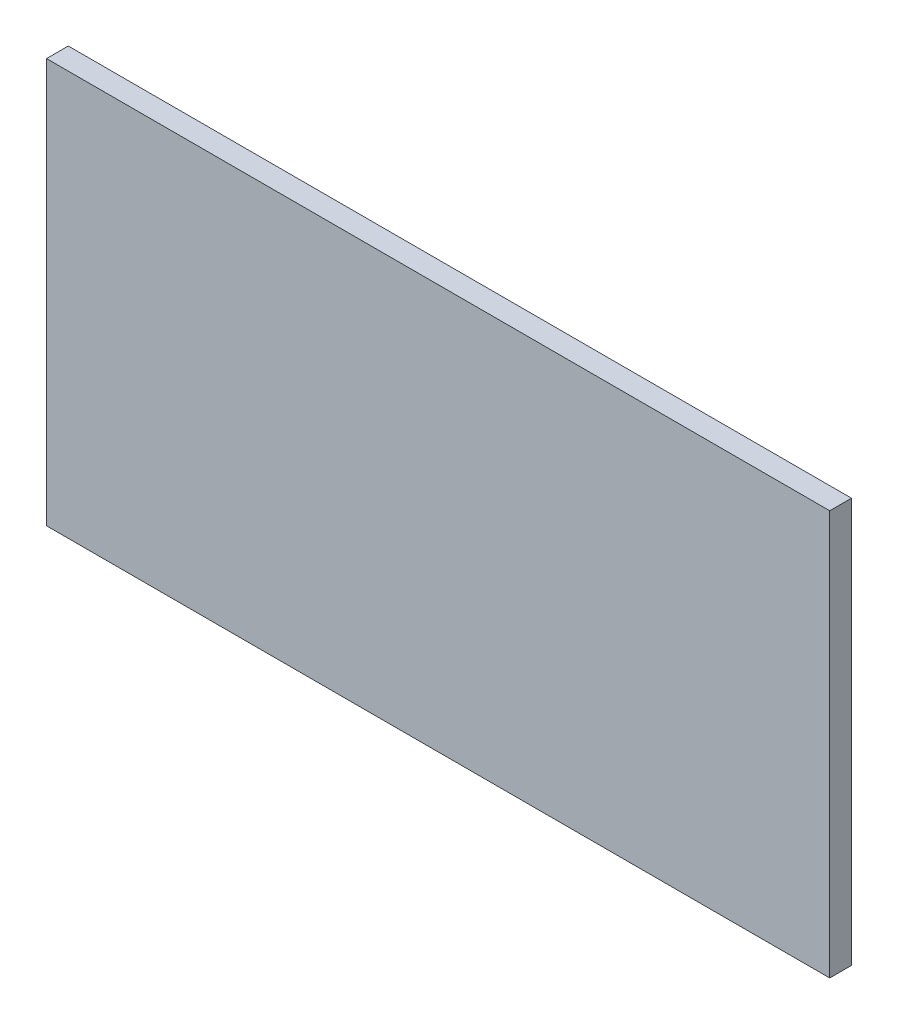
ISO-10303-21;
HEADER;
FILE_DESCRIPTION(('STEP AP214'),'2;1');
FILE_NAME('part.step','',(''),(''),'','','');
FILE_SCHEMA(('AUTOMOTIVE_DESIGN { 1 0 10303 214 1 1 1 1 }'));
ENDSEC;
DATA;
#1=APPLICATION_CONTEXT('core data for automotive mechanical design processes');
#2=APPLICATION_PROTOCOL_DEFINITION('international standard','automotive_design',2000,#1);
#3=PRODUCT_CONTEXT('',#1,'mechanical');
#4=PRODUCT('Part','Part','',(#3));
#5=PRODUCT_RELATED_PRODUCT_CATEGORY('part','',(#4));
#6=PRODUCT_DEFINITION_FORMATION('','',#4);
#7=PRODUCT_DEFINITION_CONTEXT('part definition',#1,'design');
#8=PRODUCT_DEFINITION('design','',#6,#7);
#9=PRODUCT_DEFINITION_SHAPE('','',#8);
#10=(LENGTH_UNIT() NAMED_UNIT(*) SI_UNIT(.MILLI.,.METRE.));
#11=(NAMED_UNIT(*) PLANE_ANGLE_UNIT() SI_UNIT($,.RADIAN.));
#12=(NAMED_UNIT(*) SI_UNIT($,.STERADIAN.) SOLID_ANGLE_UNIT());
#13=UNCERTAINTY_MEASURE_WITH_UNIT(LENGTH_MEASURE(1.E-05),#10,'distance_accuracy_value','');
#14=(GEOMETRIC_REPRESENTATION_CONTEXT(3) GLOBAL_UNCERTAINTY_ASSIGNED_CONTEXT((#13)) GLOBAL_UNIT_ASSIGNED_CONTEXT((#10,
#11,#12)) REPRESENTATION_CONTEXT('',''));
#15=CARTESIAN_POINT('',(0.,0.,0.));
#16=DIRECTION('',(0.,0.,1.));
#17=DIRECTION('',(1.,0.,0.));
#18=AXIS2_PLACEMENT_3D('',#15,#16,#17);
#19=CARTESIAN_POINT('',(-90.,46.5,5.));
#20=DIRECTION('',(1.,0.,0.));
#21=DIRECTION('',(0.,0.,-1.));
#22=AXIS2_PLACEMENT_3D('',#19,#20,#21);
#23=PLANE('',#22);
#24=DIRECTION('',(0.,-1.,0.));
#25=VECTOR('',#24,1.);
#26=CARTESIAN_POINT('',(-90.,46.5,0.));
#27=LINE('',#26,#25);
#28=CARTESIAN_POINT('',(-90.,46.5,0.));
#29=VERTEX_POINT('',#28);
#30=CARTESIAN_POINT('',(-90.,-46.5,0.));
#31=VERTEX_POINT('',#30);
#32=EDGE_CURVE('E70',#29,#31,#27,.T.);
#33=ORIENTED_EDGE('',*,*,#32,.T.);
#34=DIRECTION('',(0.,0.,-1.));
#35=VECTOR('',#34,1.);
#36=CARTESIAN_POINT('',(-90.,-46.5,5.));
#37=LINE('',#36,#35);
#38=CARTESIAN_POINT('',(-90.,-46.5,5.));
#39=VERTEX_POINT('',#38);
#40=EDGE_CURVE('E11',#39,#31,#37,.T.);
#41=ORIENTED_EDGE('',*,*,#40,.F.);
#42=DIRECTION('',(0.,-1.,0.));
#43=VECTOR('',#42,1.);
#44=CARTESIAN_POINT('',(-90.,46.5,5.));
#45=LINE('',#44,#43);
#46=CARTESIAN_POINT('',(-90.,46.5,5.));
#47=VERTEX_POINT('',#46);
#48=EDGE_CURVE('E88',#47,#39,#45,.T.);
#49=ORIENTED_EDGE('',*,*,#48,.F.);
#50=DIRECTION('',(0.,0.,-1.));
#51=VECTOR('',#50,1.);
#52=CARTESIAN_POINT('',(-90.,46.5,5.));
#53=LINE('',#52,#51);
#54=EDGE_CURVE('E82',#47,#29,#53,.T.);
#55=ORIENTED_EDGE('',*,*,#54,.T.);
#56=EDGE_LOOP('',(#33,#41,#49,#55));
#57=FACE_BOUND('',#56,.T.);
#58=ADVANCED_FACE('F26',(#57),#23,.F.);
#59=CARTESIAN_POINT('',(-90.,-46.5,5.));
#60=DIRECTION('',(0.,1.,0.));
#61=DIRECTION('',(0.,0.,1.));
#62=AXIS2_PLACEMENT_3D('',#59,#60,#61);
#63=PLANE('',#62);
#64=DIRECTION('',(1.,0.,0.));
#65=VECTOR('',#64,1.);
#66=CARTESIAN_POINT('',(-90.,-46.5,0.));
#67=LINE('',#66,#65);
#68=CARTESIAN_POINT('',(90.,-46.5,0.));
#69=VERTEX_POINT('',#68);
#70=EDGE_CURVE('E66',#31,#69,#67,.T.);
#71=ORIENTED_EDGE('',*,*,#70,.T.);
#72=DIRECTION('',(0.,0.,-1.));
#73=VECTOR('',#72,1.);
#74=CARTESIAN_POINT('',(90.,-46.5,5.));
#75=LINE('',#74,#73);
#76=CARTESIAN_POINT('',(90.,-46.5,5.));
#77=VERTEX_POINT('',#76);
#78=EDGE_CURVE('E33',#77,#69,#75,.T.);
#79=ORIENTED_EDGE('',*,*,#78,.F.);
#80=DIRECTION('',(1.,0.,0.));
#81=VECTOR('',#80,1.);
#82=CARTESIAN_POINT('',(-90.,-46.5,5.));
#83=LINE('',#82,#81);
#84=EDGE_CURVE('E78',#39,#77,#83,.T.);
#85=ORIENTED_EDGE('',*,*,#84,.F.);
#86=ORIENTED_EDGE('',*,*,#40,.T.);
#87=EDGE_LOOP('',(#71,#79,#85,#86));
#88=FACE_BOUND('',#87,.T.);
#89=ADVANCED_FACE('F77',(#88),#63,.F.);
#90=CARTESIAN_POINT('',(90.,46.5,5.));
#91=DIRECTION('',(-1.,0.,0.));
#92=DIRECTION('',(0.,0.,1.));
#93=AXIS2_PLACEMENT_3D('',#90,#91,#92);
#94=PLANE('',#93);
#95=DIRECTION('',(0.,1.,0.));
#96=VECTOR('',#95,1.);
#97=CARTESIAN_POINT('',(90.,46.5,0.));
#98=LINE('',#97,#96);
#99=CARTESIAN_POINT('',(90.,46.5,0.));
#100=VERTEX_POINT('',#99);
#101=EDGE_CURVE('E71',#69,#100,#98,.T.);
#102=ORIENTED_EDGE('',*,*,#101,.T.);
#103=DIRECTION('',(0.,0.,-1.));
#104=VECTOR('',#103,1.);
#105=CARTESIAN_POINT('',(90.,46.5,5.));
#106=LINE('',#105,#104);
#107=CARTESIAN_POINT('',(90.,46.5,5.));
#108=VERTEX_POINT('',#107);
#109=EDGE_CURVE('E94',#108,#100,#106,.T.);
#110=ORIENTED_EDGE('',*,*,#109,.F.);
#111=DIRECTION('',(0.,1.,0.));
#112=VECTOR('',#111,1.);
#113=CARTESIAN_POINT('',(90.,46.5,5.));
#114=LINE('',#113,#112);
#115=EDGE_CURVE('E45',#77,#108,#114,.T.);
#116=ORIENTED_EDGE('',*,*,#115,.F.);
#117=ORIENTED_EDGE('',*,*,#78,.T.);
#118=EDGE_LOOP('',(#102,#110,#116,#117));
#119=FACE_BOUND('',#118,.T.);
#120=ADVANCED_FACE('F97',(#119),#94,.F.);
#121=CARTESIAN_POINT('',(-90.,46.5,5.));
#122=DIRECTION('',(0.,-1.,0.));
#123=DIRECTION('',(0.,0.,-1.));
#124=AXIS2_PLACEMENT_3D('',#121,#122,#123);
#125=PLANE('',#124);
#126=DIRECTION('',(-1.,0.,0.));
#127=VECTOR('',#126,1.);
#128=CARTESIAN_POINT('',(-90.,46.5,0.));
#129=LINE('',#128,#127);
#130=EDGE_CURVE('E86',#100,#29,#129,.T.);
#131=ORIENTED_EDGE('',*,*,#130,.T.);
#132=ORIENTED_EDGE('',*,*,#54,.F.);
#133=DIRECTION('',(-1.,0.,0.));
#134=VECTOR('',#133,1.);
#135=CARTESIAN_POINT('',(-90.,46.5,5.));
#136=LINE('',#135,#134);
#137=EDGE_CURVE('E40',#108,#47,#136,.T.);
#138=ORIENTED_EDGE('',*,*,#137,.F.);
#139=ORIENTED_EDGE('',*,*,#109,.T.);
#140=EDGE_LOOP('',(#131,#132,#138,#139));
#141=FACE_BOUND('',#140,.T.);
#142=ADVANCED_FACE('F99',(#141),#125,.F.);
#143=CARTESIAN_POINT('',(-90.,-46.5,5.));
#144=DIRECTION('',(0.,0.,1.));
#145=DIRECTION('',(1.,0.,0.));
#146=AXIS2_PLACEMENT_3D('',#143,#144,#145);
#147=PLANE('',#146);
#148=ORIENTED_EDGE('',*,*,#48,.T.);
#149=ORIENTED_EDGE('',*,*,#84,.T.);
#150=ORIENTED_EDGE('',*,*,#115,.T.);
#151=ORIENTED_EDGE('',*,*,#137,.T.);
#152=EDGE_LOOP('',(#148,#149,#150,#151));
#153=FACE_BOUND('',#152,.T.);
#154=ADVANCED_FACE('F100',(#153),#147,.T.);
#155=CARTESIAN_POINT('',(-90.,-46.5,0.));
#156=DIRECTION('',(0.,0.,1.));
#157=DIRECTION('',(1.,0.,0.));
#158=AXIS2_PLACEMENT_3D('',#155,#156,#157);
#159=PLANE('',#158);
#160=ORIENTED_EDGE('',*,*,#32,.F.);
#161=ORIENTED_EDGE('',*,*,#130,.F.);
#162=ORIENTED_EDGE('',*,*,#101,.F.);
#163=ORIENTED_EDGE('',*,*,#70,.F.);
#164=EDGE_LOOP('',(#160,#161,#162,#163));
#165=FACE_BOUND('',#164,.T.);
#166=ADVANCED_FACE('F67',(#165),#159,.F.);
#167=CLOSED_SHELL('',(#58,#89,#120,#142,#154,#166));
#168=MANIFOLD_SOLID_BREP('B2',#167);
#169=ADVANCED_BREP_SHAPE_REPRESENTATION('',(#18,#168),#14);
#170=SHAPE_DEFINITION_REPRESENTATION(#9,#169);
ENDSEC;
END-ISO-10303-21;
